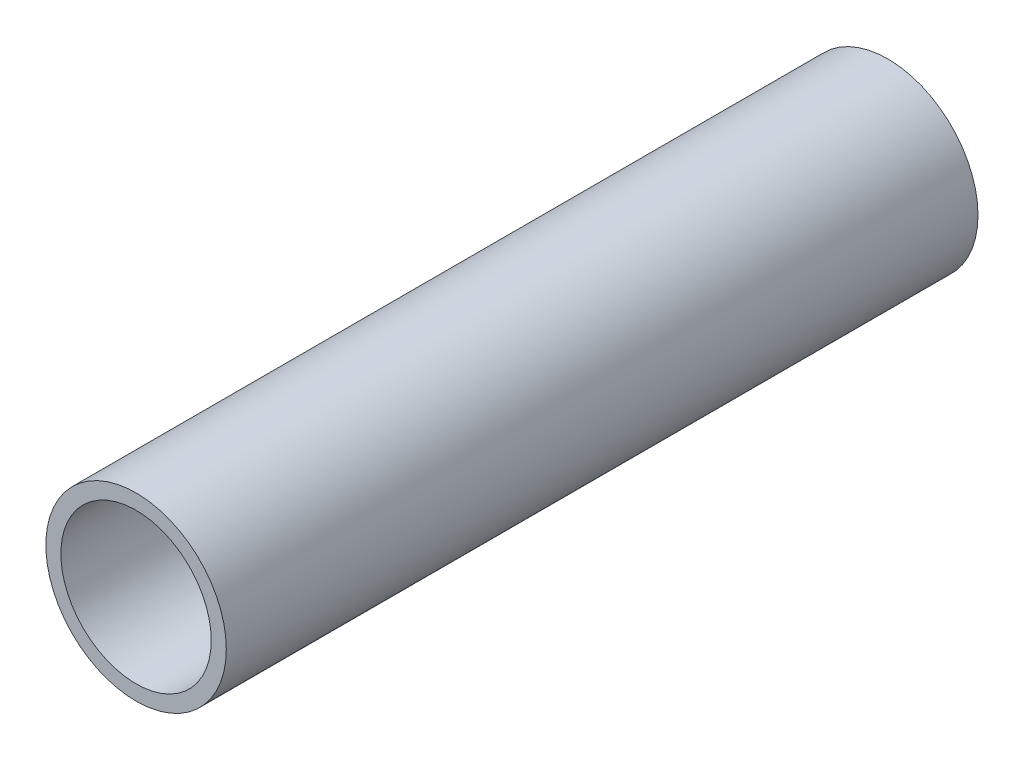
from build123d import *

# Parameters (mm, degrees)
SKETCH1_R               = 60
SKETCH1_R_2             = 50
BASE_EXTRUDE_THIN_DEPTH = 249.95


with BuildPart() as part:
    # Sketch1 → Base-Extrude-Thin (new, symmetric)
    with BuildSketch(Plane.XY):
        Circle(SKETCH1_R)
        Circle(SKETCH1_R_2, mode=Mode.SUBTRACT)
    extrude(amount=BASE_EXTRUDE_THIN_DEPTH, both=True)


solid = part.part
